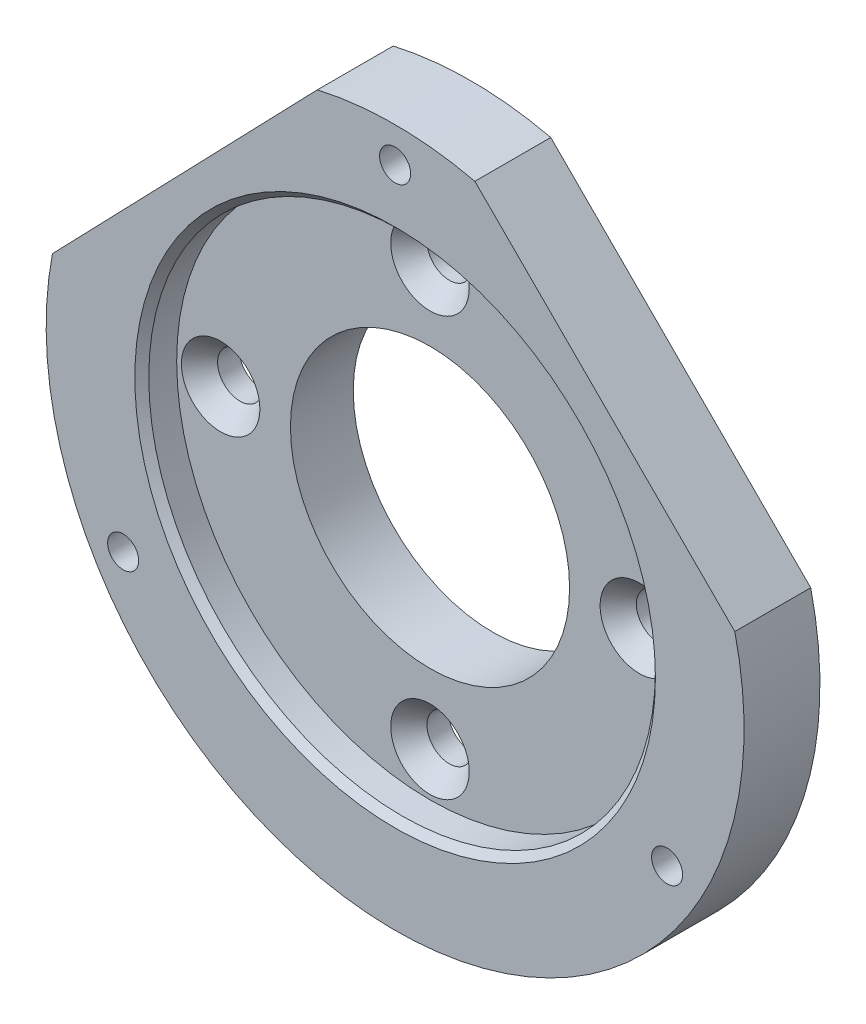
ISO-10303-21;
HEADER;
FILE_DESCRIPTION(('STEP AP214'),'2;1');
FILE_NAME('part.step','',(''),(''),'','','');
FILE_SCHEMA(('AUTOMOTIVE_DESIGN { 1 0 10303 214 1 1 1 1 }'));
ENDSEC;
DATA;
#1=APPLICATION_CONTEXT('core data for automotive mechanical design processes');
#2=APPLICATION_PROTOCOL_DEFINITION('international standard','automotive_design',2000,#1);
#3=PRODUCT_CONTEXT('',#1,'mechanical');
#4=PRODUCT('Part','Part','',(#3));
#5=PRODUCT_RELATED_PRODUCT_CATEGORY('part','',(#4));
#6=PRODUCT_DEFINITION_FORMATION('','',#4);
#7=PRODUCT_DEFINITION_CONTEXT('part definition',#1,'design');
#8=PRODUCT_DEFINITION('design','',#6,#7);
#9=PRODUCT_DEFINITION_SHAPE('','',#8);
#10=(LENGTH_UNIT() NAMED_UNIT(*) SI_UNIT(.MILLI.,.METRE.));
#11=(NAMED_UNIT(*) PLANE_ANGLE_UNIT() SI_UNIT($,.RADIAN.));
#12=(NAMED_UNIT(*) SI_UNIT($,.STERADIAN.) SOLID_ANGLE_UNIT());
#13=UNCERTAINTY_MEASURE_WITH_UNIT(LENGTH_MEASURE(1.E-05),#10,'distance_accuracy_value','');
#14=(GEOMETRIC_REPRESENTATION_CONTEXT(3) GLOBAL_UNCERTAINTY_ASSIGNED_CONTEXT((#13)) GLOBAL_UNIT_ASSIGNED_CONTEXT((#10,
#11,#12)) REPRESENTATION_CONTEXT('',''));
#15=CARTESIAN_POINT('',(0.,0.,0.));
#16=DIRECTION('',(0.,0.,1.));
#17=DIRECTION('',(1.,0.,0.));
#18=AXIS2_PLACEMENT_3D('',#15,#16,#17);
#19=CARTESIAN_POINT('',(0.,0.,7.112));
#20=DIRECTION('',(0.,0.,-1.));
#21=DIRECTION('',(-1.,0.,0.));
#22=AXIS2_PLACEMENT_3D('',#19,#20,#21);
#23=CYLINDRICAL_SURFACE('',#22,25.4);
#24=CARTESIAN_POINT('',(0.,0.,7.112));
#25=DIRECTION('',(0.,0.,1.));
#26=DIRECTION('',(1.,0.,0.));
#27=AXIS2_PLACEMENT_3D('',#24,#25,#26);
#28=CIRCLE('',#27,25.4);
#29=CARTESIAN_POINT('',(-24.9441152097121,4.790732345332,7.112));
#30=VERTEX_POINT('',#29);
#31=CARTESIAN_POINT('',(24.7277223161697,5.8051484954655,7.112));
#32=VERTEX_POINT('',#31);
#33=EDGE_CURVE('E100',#30,#32,#28,.T.);
#34=ORIENTED_EDGE('',*,*,#33,.F.);
#35=DIRECTION('',(0.,0.,-1.));
#36=VECTOR('',#35,1.);
#37=CARTESIAN_POINT('',(-24.9441152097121,4.79073234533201,7.112));
#38=LINE('',#37,#36);
#39=CARTESIAN_POINT('',(-24.9441152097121,4.79073234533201,1.5875));
#40=VERTEX_POINT('',#39);
#41=EDGE_CURVE('E84',#30,#40,#38,.T.);
#42=ORIENTED_EDGE('',*,*,#41,.T.);
#43=CARTESIAN_POINT('',(0.,0.,1.5875));
#44=DIRECTION('',(0.,0.,-1.));
#45=DIRECTION('',(-1.,0.,0.));
#46=AXIS2_PLACEMENT_3D('',#43,#44,#45);
#47=CIRCLE('',#46,25.4);
#48=CARTESIAN_POINT('',(24.7277223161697,5.80514849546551,1.5875));
#49=VERTEX_POINT('',#48);
#50=EDGE_CURVE('E178',#49,#40,#47,.T.);
#51=ORIENTED_EDGE('',*,*,#50,.F.);
#52=DIRECTION('',(0.,0.,-1.));
#53=VECTOR('',#52,1.);
#54=CARTESIAN_POINT('',(24.7277223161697,5.8051484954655,7.112));
#55=LINE('',#54,#53);
#56=EDGE_CURVE('E66',#49,#32,#55,.F.);
#57=ORIENTED_EDGE('',*,*,#56,.T.);
#58=EDGE_LOOP('',(#34,#42,#51,#57));
#59=FACE_BOUND('',#58,.T.);
#60=ADVANCED_FACE('F43',(#59),#23,.T.);
#61=CARTESIAN_POINT('',(-5.6623451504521,24.7608127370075,1.5875));
#62=VERTEX_POINT('',#61);
#63=CARTESIAN_POINT('',(5.80514849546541,24.7277223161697,1.5875));
#64=VERTEX_POINT('',#63);
#65=EDGE_CURVE('E175',#62,#64,#47,.T.);
#66=ORIENTED_EDGE('',*,*,#65,.F.);
#67=DIRECTION('',(0.,0.,-1.));
#68=VECTOR('',#67,1.);
#69=CARTESIAN_POINT('',(-5.6623451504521,24.7608127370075,7.112));
#70=LINE('',#69,#68);
#71=CARTESIAN_POINT('',(-5.66234515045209,24.7608127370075,7.112));
#72=VERTEX_POINT('',#71);
#73=EDGE_CURVE('E58',#62,#72,#70,.F.);
#74=ORIENTED_EDGE('',*,*,#73,.T.);
#75=CARTESIAN_POINT('',(5.8051484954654,24.7277223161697,7.112));
#76=VERTEX_POINT('',#75);
#77=EDGE_CURVE('E102',#76,#72,#28,.T.);
#78=ORIENTED_EDGE('',*,*,#77,.F.);
#79=DIRECTION('',(0.,0.,-1.));
#80=VECTOR('',#79,1.);
#81=CARTESIAN_POINT('',(5.8051484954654,24.7277223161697,7.112));
#82=LINE('',#81,#80);
#83=EDGE_CURVE('E176',#76,#64,#82,.T.);
#84=ORIENTED_EDGE('',*,*,#83,.T.);
#85=EDGE_LOOP('',(#66,#74,#78,#84));
#86=FACE_BOUND('',#85,.T.);
#87=ADVANCED_FACE('F45',(#86),#23,.T.);
#88=CARTESIAN_POINT('',(0.,0.,0.));
#89=DIRECTION('',(0.,0.,1.));
#90=DIRECTION('',(1.,0.,0.));
#91=AXIS2_PLACEMENT_3D('',#88,#89,#90);
#92=PLANE('',#91);
#93=CARTESIAN_POINT('',(0.,0.,0.));
#94=DIRECTION('',(0.,0.,1.));
#95=DIRECTION('',(1.,0.,0.));
#96=AXIS2_PLACEMENT_3D('',#93,#94,#95);
#97=CIRCLE('',#96,12.4206);
#98=CARTESIAN_POINT('',(12.4206,0.,0.));
#99=VERTEX_POINT('',#98);
#100=EDGE_CURVE('E51',#99,#99,#97,.F.);
#101=ORIENTED_EDGE('',*,*,#100,.T.);
#102=EDGE_LOOP('',(#101));
#103=FACE_BOUND('',#102,.T.);
#104=CARTESIAN_POINT('',(0.,0.,0.));
#105=DIRECTION('',(0.,0.,-1.));
#106=DIRECTION('',(-1.,0.,0.));
#107=AXIS2_PLACEMENT_3D('',#104,#105,#106);
#108=CIRCLE('',#107,10.16);
#109=CARTESIAN_POINT('',(-10.16,0.,0.));
#110=VERTEX_POINT('',#109);
#111=EDGE_CURVE('E104',#110,#110,#108,.T.);
#112=ORIENTED_EDGE('',*,*,#111,.F.);
#113=EDGE_LOOP('',(#112));
#114=FACE_BOUND('',#113,.T.);
#115=ADVANCED_FACE('F149',(#103,#114),#92,.F.);
#116=CARTESIAN_POINT('',(19.7973407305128,-11.4299999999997,0.));
#117=DIRECTION('',(0.,0.,1.));
#118=DIRECTION('',(1.,0.,0.));
#119=AXIS2_PLACEMENT_3D('',#116,#117,#118);
#120=CYLINDRICAL_SURFACE('',#119,1.13030000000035);
#121=CARTESIAN_POINT('',(19.7973407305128,-11.4299999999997,7.112));
#122=DIRECTION('',(0.,0.,1.));
#123=DIRECTION('',(1.,0.,0.));
#124=AXIS2_PLACEMENT_3D('',#121,#122,#123);
#125=CIRCLE('',#124,1.13030000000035);
#126=CARTESIAN_POINT('',(20.9276407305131,-11.4299999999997,7.112));
#127=VERTEX_POINT('',#126);
#128=EDGE_CURVE('E191',#127,#127,#125,.T.);
#129=ORIENTED_EDGE('',*,*,#128,.T.);
#130=EDGE_LOOP('',(#129));
#131=FACE_BOUND('',#130,.T.);
#132=CARTESIAN_POINT('',(19.7973407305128,-11.4299999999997,1.5875));
#133=DIRECTION('',(0.,0.,-1.));
#134=DIRECTION('',(-1.,0.,0.));
#135=AXIS2_PLACEMENT_3D('',#132,#133,#134);
#136=CIRCLE('',#135,1.13030000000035);
#137=CARTESIAN_POINT('',(18.6670407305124,-11.4299999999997,1.5875));
#138=VERTEX_POINT('',#137);
#139=EDGE_CURVE('E179',#138,#138,#136,.F.);
#140=ORIENTED_EDGE('',*,*,#139,.F.);
#141=EDGE_LOOP('',(#140));
#142=FACE_BOUND('',#141,.T.);
#143=ADVANCED_FACE('F171',(#131,#142),#120,.F.);
#144=CARTESIAN_POINT('',(-19.7973407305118,-11.4300000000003,0.));
#145=DIRECTION('',(0.,0.,1.));
#146=DIRECTION('',(1.,0.,0.));
#147=AXIS2_PLACEMENT_3D('',#144,#145,#146);
#148=CYLINDRICAL_SURFACE('',#147,1.13030000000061);
#149=CARTESIAN_POINT('',(-19.7973407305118,-11.4300000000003,7.112));
#150=DIRECTION('',(0.,0.,1.));
#151=DIRECTION('',(1.,0.,0.));
#152=AXIS2_PLACEMENT_3D('',#149,#150,#151);
#153=CIRCLE('',#152,1.13030000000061);
#154=CARTESIAN_POINT('',(-18.6670407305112,-11.4300000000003,7.112));
#155=VERTEX_POINT('',#154);
#156=EDGE_CURVE('E188',#155,#155,#153,.T.);
#157=ORIENTED_EDGE('',*,*,#156,.T.);
#158=EDGE_LOOP('',(#157));
#159=FACE_BOUND('',#158,.T.);
#160=CARTESIAN_POINT('',(-19.7973407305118,-11.4300000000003,1.5875));
#161=DIRECTION('',(0.,0.,-1.));
#162=DIRECTION('',(-1.,0.,0.));
#163=AXIS2_PLACEMENT_3D('',#160,#161,#162);
#164=CIRCLE('',#163,1.13030000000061);
#165=CARTESIAN_POINT('',(-20.9276407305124,-11.4300000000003,1.5875));
#166=VERTEX_POINT('',#165);
#167=EDGE_CURVE('E118',#166,#166,#164,.F.);
#168=ORIENTED_EDGE('',*,*,#167,.F.);
#169=EDGE_LOOP('',(#168));
#170=FACE_BOUND('',#169,.T.);
#171=ADVANCED_FACE('F384',(#159,#170),#148,.F.);
#172=CARTESIAN_POINT('',(0.,22.86,0.));
#173=DIRECTION('',(0.,0.,1.));
#174=DIRECTION('',(1.,0.,0.));
#175=AXIS2_PLACEMENT_3D('',#172,#173,#174);
#176=CYLINDRICAL_SURFACE('',#175,1.13029999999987);
#177=CARTESIAN_POINT('',(0.,22.86,7.112));
#178=DIRECTION('',(0.,0.,1.));
#179=DIRECTION('',(1.,0.,0.));
#180=AXIS2_PLACEMENT_3D('',#177,#178,#179);
#181=CIRCLE('',#180,1.13029999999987);
#182=CARTESIAN_POINT('',(1.13029999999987,22.86,7.112));
#183=VERTEX_POINT('',#182);
#184=EDGE_CURVE('E181',#183,#183,#181,.T.);
#185=ORIENTED_EDGE('',*,*,#184,.T.);
#186=EDGE_LOOP('',(#185));
#187=FACE_BOUND('',#186,.T.);
#188=CARTESIAN_POINT('',(0.,22.86,1.5875));
#189=DIRECTION('',(0.,0.,-1.));
#190=DIRECTION('',(-1.,0.,0.));
#191=AXIS2_PLACEMENT_3D('',#188,#189,#190);
#192=CIRCLE('',#191,1.13029999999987);
#193=CARTESIAN_POINT('',(-1.13029999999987,22.86,1.5875));
#194=VERTEX_POINT('',#193);
#195=EDGE_CURVE('E115',#194,#194,#192,.F.);
#196=ORIENTED_EDGE('',*,*,#195,.F.);
#197=EDGE_LOOP('',(#196));
#198=FACE_BOUND('',#197,.T.);
#199=ADVANCED_FACE('F216',(#187,#198),#176,.F.);
#200=CARTESIAN_POINT('',(0.,0.,7.112));
#201=DIRECTION('',(0.,0.,-1.));
#202=DIRECTION('',(-1.,0.,0.));
#203=AXIS2_PLACEMENT_3D('',#200,#201,#202);
#204=CYLINDRICAL_SURFACE('',#203,10.16);
#205=ORIENTED_EDGE('',*,*,#111,.T.);
#206=EDGE_LOOP('',(#205));
#207=FACE_BOUND('',#206,.T.);
#208=CARTESIAN_POINT('',(0.,0.,4.572));
#209=DIRECTION('',(0.,0.,1.));
#210=DIRECTION('',(1.,0.,0.));
#211=AXIS2_PLACEMENT_3D('',#208,#209,#210);
#212=CIRCLE('',#211,10.16);
#213=CARTESIAN_POINT('',(10.16,0.,4.572));
#214=VERTEX_POINT('',#213);
#215=EDGE_CURVE('E108',#214,#214,#212,.F.);
#216=ORIENTED_EDGE('',*,*,#215,.F.);
#217=EDGE_LOOP('',(#216));
#218=FACE_BOUND('',#217,.T.);
#219=ADVANCED_FACE('F214',(#207,#218),#204,.F.);
#220=CARTESIAN_POINT('',(0.,0.,7.112));
#221=DIRECTION('',(0.,0.,1.));
#222=DIRECTION('',(1.,0.,0.));
#223=AXIS2_PLACEMENT_3D('',#220,#221,#222);
#224=PLANE('',#223);
#225=CARTESIAN_POINT('',(0.,0.,7.112));
#226=DIRECTION('',(0.,0.,1.));
#227=DIRECTION('',(1.,0.,0.));
#228=AXIS2_PLACEMENT_3D('',#225,#226,#227);
#229=CIRCLE('',#228,18.9484);
#230=CARTESIAN_POINT('',(18.9484,0.,7.112));
#231=VERTEX_POINT('',#230);
#232=EDGE_CURVE('E144',#231,#231,#229,.F.);
#233=ORIENTED_EDGE('',*,*,#232,.T.);
#234=EDGE_LOOP('',(#233));
#235=FACE_BOUND('',#234,.T.);
#236=DIRECTION('',(0.694600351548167,0.719395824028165,0.));
#237=VECTOR('',#236,1.);
#238=CARTESIAN_POINT('',(-0.972137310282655,29.6184491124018,7.112));
#239=LINE('',#238,#237);
#240=EDGE_CURVE('E87',#30,#72,#239,.T.);
#241=ORIENTED_EDGE('',*,*,#240,.F.);
#242=ORIENTED_EDGE('',*,*,#33,.T.);
#243=DIRECTION('',(0.707106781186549,-0.707106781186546,0.));
#244=VECTOR('',#243,1.);
#245=CARTESIAN_POINT('',(0.898025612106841,29.6348451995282,7.112));
#246=LINE('',#245,#244);
#247=EDGE_CURVE('E93',#76,#32,#246,.T.);
#248=ORIENTED_EDGE('',*,*,#247,.F.);
#249=ORIENTED_EDGE('',*,*,#77,.T.);
#250=EDGE_LOOP('',(#241,#242,#248,#249));
#251=FACE_BOUND('',#250,.T.);
#252=ORIENTED_EDGE('',*,*,#184,.F.);
#253=EDGE_LOOP('',(#252));
#254=FACE_BOUND('',#253,.T.);
#255=ORIENTED_EDGE('',*,*,#156,.F.);
#256=EDGE_LOOP('',(#255));
#257=FACE_BOUND('',#256,.T.);
#258=ORIENTED_EDGE('',*,*,#128,.F.);
#259=EDGE_LOOP('',(#258));
#260=FACE_BOUND('',#259,.T.);
#261=ADVANCED_FACE('F97',(#235,#251,#254,#257,#260),#224,.T.);
#262=CARTESIAN_POINT('',(0.,0.,4.572));
#263=DIRECTION('',(0.,0.,1.));
#264=DIRECTION('',(1.,0.,0.));
#265=AXIS2_PLACEMENT_3D('',#262,#263,#264);
#266=PLANE('',#265);
#267=CARTESIAN_POINT('',(15.24,0.,4.572));
#268=DIRECTION('',(0.,0.,1.));
#269=DIRECTION('',(1.,0.,0.));
#270=AXIS2_PLACEMENT_3D('',#267,#268,#269);
#271=CIRCLE('',#270,2.8575);
#272=CARTESIAN_POINT('',(18.0975,0.,4.572));
#273=VERTEX_POINT('',#272);
#274=EDGE_CURVE('E138',#273,#273,#271,.T.);
#275=ORIENTED_EDGE('',*,*,#274,.F.);
#276=EDGE_LOOP('',(#275));
#277=FACE_BOUND('',#276,.T.);
#278=CARTESIAN_POINT('',(0.,-15.24,4.572));
#279=DIRECTION('',(0.,0.,1.));
#280=DIRECTION('',(1.,0.,0.));
#281=AXIS2_PLACEMENT_3D('',#278,#279,#280);
#282=CIRCLE('',#281,2.8575);
#283=CARTESIAN_POINT('',(2.85749999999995,-15.24,4.572));
#284=VERTEX_POINT('',#283);
#285=EDGE_CURVE('E133',#284,#284,#282,.T.);
#286=ORIENTED_EDGE('',*,*,#285,.F.);
#287=EDGE_LOOP('',(#286));
#288=FACE_BOUND('',#287,.T.);
#289=CARTESIAN_POINT('',(-15.24,1.06251812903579E-13,4.572));
#290=DIRECTION('',(0.,0.,1.));
#291=DIRECTION('',(1.,0.,0.));
#292=AXIS2_PLACEMENT_3D('',#289,#290,#291);
#293=CIRCLE('',#292,2.8575);
#294=CARTESIAN_POINT('',(-12.3825,1.06251812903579E-13,4.572));
#295=VERTEX_POINT('',#294);
#296=EDGE_CURVE('E128',#295,#295,#293,.T.);
#297=ORIENTED_EDGE('',*,*,#296,.F.);
#298=EDGE_LOOP('',(#297));
#299=FACE_BOUND('',#298,.T.);
#300=CARTESIAN_POINT('',(1.59594559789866E-13,15.24,4.572));
#301=DIRECTION('',(0.,0.,1.));
#302=DIRECTION('',(1.,0.,0.));
#303=AXIS2_PLACEMENT_3D('',#300,#301,#302);
#304=CIRCLE('',#303,2.8575);
#305=CARTESIAN_POINT('',(2.85750000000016,15.24,4.572));
#306=VERTEX_POINT('',#305);
#307=EDGE_CURVE('E123',#306,#306,#304,.T.);
#308=ORIENTED_EDGE('',*,*,#307,.F.);
#309=EDGE_LOOP('',(#308));
#310=FACE_BOUND('',#309,.T.);
#311=CARTESIAN_POINT('',(0.,0.,4.572));
#312=DIRECTION('',(0.,0.,1.));
#313=DIRECTION('',(1.,0.,0.));
#314=AXIS2_PLACEMENT_3D('',#311,#312,#313);
#315=CIRCLE('',#314,18.4404);
#316=CARTESIAN_POINT('',(18.4404,0.,4.572));
#317=VERTEX_POINT('',#316);
#318=EDGE_CURVE('E114',#317,#317,#315,.T.);
#319=ORIENTED_EDGE('',*,*,#318,.T.);
#320=EDGE_LOOP('',(#319));
#321=FACE_BOUND('',#320,.T.);
#322=ORIENTED_EDGE('',*,*,#215,.T.);
#323=EDGE_LOOP('',(#322));
#324=FACE_BOUND('',#323,.T.);
#325=ADVANCED_FACE('F196',(#277,#288,#299,#310,#321,#324),#266,.T.);
#326=CARTESIAN_POINT('',(0.,0.,4.572));
#327=DIRECTION('',(0.,0.,1.));
#328=DIRECTION('',(1.,0.,0.));
#329=AXIS2_PLACEMENT_3D('',#326,#327,#328);
#330=CYLINDRICAL_SURFACE('',#329,18.4404);
#331=CARTESIAN_POINT('',(0.,0.,6.60400000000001));
#332=DIRECTION('',(0.,0.,1.));
#333=DIRECTION('',(1.,0.,0.));
#334=AXIS2_PLACEMENT_3D('',#331,#332,#333);
#335=CIRCLE('',#334,18.4404);
#336=CARTESIAN_POINT('',(18.4404,0.,6.60400000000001));
#337=VERTEX_POINT('',#336);
#338=EDGE_CURVE('E141',#337,#337,#335,.T.);
#339=ORIENTED_EDGE('',*,*,#338,.T.);
#340=EDGE_LOOP('',(#339));
#341=FACE_BOUND('',#340,.T.);
#342=ORIENTED_EDGE('',*,*,#318,.F.);
#343=EDGE_LOOP('',(#342));
#344=FACE_BOUND('',#343,.T.);
#345=ADVANCED_FACE('F199',(#341,#344),#330,.F.);
#346=CARTESIAN_POINT('',(0.,0.,1.5875));
#347=DIRECTION('',(0.,0.,-1.));
#348=DIRECTION('',(-1.,0.,0.));
#349=AXIS2_PLACEMENT_3D('',#346,#347,#348);
#350=PLANE('',#349);
#351=DIRECTION('',(-0.694600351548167,-0.719395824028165,0.));
#352=VECTOR('',#351,1.);
#353=CARTESIAN_POINT('',(-15.3032301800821,14.7757725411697,1.5875));
#354=LINE('',#353,#352);
#355=EDGE_CURVE('E88',#62,#40,#354,.T.);
#356=ORIENTED_EDGE('',*,*,#355,.F.);
#357=ORIENTED_EDGE('',*,*,#65,.T.);
#358=DIRECTION('',(-0.707106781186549,0.707106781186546,0.));
#359=VECTOR('',#358,1.);
#360=CARTESIAN_POINT('',(15.2664354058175,15.2664354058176,1.5875));
#361=LINE('',#360,#359);
#362=EDGE_CURVE('E106',#49,#64,#361,.T.);
#363=ORIENTED_EDGE('',*,*,#362,.F.);
#364=ORIENTED_EDGE('',*,*,#50,.T.);
#365=EDGE_LOOP('',(#356,#357,#363,#364));
#366=FACE_BOUND('',#365,.T.);
#367=CARTESIAN_POINT('',(15.24,0.,1.5875));
#368=DIRECTION('',(0.,0.,-1.));
#369=DIRECTION('',(-1.,0.,0.));
#370=AXIS2_PLACEMENT_3D('',#367,#368,#369);
#371=CIRCLE('',#370,1.63195);
#372=CARTESIAN_POINT('',(13.60805,0.,1.5875));
#373=VERTEX_POINT('',#372);
#374=EDGE_CURVE('E134',#373,#373,#371,.T.);
#375=ORIENTED_EDGE('',*,*,#374,.F.);
#376=EDGE_LOOP('',(#375));
#377=FACE_BOUND('',#376,.T.);
#378=CARTESIAN_POINT('',(0.,-15.24,1.5875));
#379=DIRECTION('',(0.,0.,-1.));
#380=DIRECTION('',(-1.,0.,0.));
#381=AXIS2_PLACEMENT_3D('',#378,#379,#380);
#382=CIRCLE('',#381,1.63195);
#383=CARTESIAN_POINT('',(-1.63195000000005,-15.24,1.5875));
#384=VERTEX_POINT('',#383);
#385=EDGE_CURVE('E129',#384,#384,#382,.T.);
#386=ORIENTED_EDGE('',*,*,#385,.F.);
#387=EDGE_LOOP('',(#386));
#388=FACE_BOUND('',#387,.T.);
#389=CARTESIAN_POINT('',(-15.24,1.06251812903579E-13,1.5875));
#390=DIRECTION('',(0.,0.,-1.));
#391=DIRECTION('',(-1.,0.,0.));
#392=AXIS2_PLACEMENT_3D('',#389,#390,#391);
#393=CIRCLE('',#392,1.63195);
#394=CARTESIAN_POINT('',(-16.87195,1.06251812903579E-13,1.5875));
#395=VERTEX_POINT('',#394);
#396=EDGE_CURVE('E124',#395,#395,#393,.T.);
#397=ORIENTED_EDGE('',*,*,#396,.F.);
#398=EDGE_LOOP('',(#397));
#399=FACE_BOUND('',#398,.T.);
#400=CARTESIAN_POINT('',(1.59594559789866E-13,15.24,1.5875));
#401=DIRECTION('',(0.,0.,-1.));
#402=DIRECTION('',(-1.,0.,0.));
#403=AXIS2_PLACEMENT_3D('',#400,#401,#402);
#404=CIRCLE('',#403,1.63195);
#405=CARTESIAN_POINT('',(-1.63194999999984,15.24,1.5875));
#406=VERTEX_POINT('',#405);
#407=EDGE_CURVE('E120',#406,#406,#404,.T.);
#408=ORIENTED_EDGE('',*,*,#407,.F.);
#409=EDGE_LOOP('',(#408));
#410=FACE_BOUND('',#409,.T.);
#411=ORIENTED_EDGE('',*,*,#139,.T.);
#412=EDGE_LOOP('',(#411));
#413=FACE_BOUND('',#412,.T.);
#414=ORIENTED_EDGE('',*,*,#195,.T.);
#415=EDGE_LOOP('',(#414));
#416=FACE_BOUND('',#415,.T.);
#417=CARTESIAN_POINT('',(0.,0.,1.5875));
#418=DIRECTION('',(0.,0.,-1.));
#419=DIRECTION('',(-1.,0.,0.));
#420=AXIS2_PLACEMENT_3D('',#417,#418,#419);
#421=CIRCLE('',#420,12.6746);
#422=CARTESIAN_POINT('',(-12.6746,0.,1.5875));
#423=VERTEX_POINT('',#422);
#424=EDGE_CURVE('E119',#423,#423,#421,.T.);
#425=ORIENTED_EDGE('',*,*,#424,.F.);
#426=EDGE_LOOP('',(#425));
#427=FACE_BOUND('',#426,.T.);
#428=ORIENTED_EDGE('',*,*,#167,.T.);
#429=EDGE_LOOP('',(#428));
#430=FACE_BOUND('',#429,.T.);
#431=ADVANCED_FACE('F201',(#366,#377,#388,#399,#410,#413,#416,#427,#430),#350,.T.);
#432=CARTESIAN_POINT('',(0.,0.,1.5875));
#433=DIRECTION('',(0.,0.,-1.));
#434=DIRECTION('',(-1.,0.,0.));
#435=AXIS2_PLACEMENT_3D('',#432,#433,#434);
#436=CYLINDRICAL_SURFACE('',#435,12.6746);
#437=CARTESIAN_POINT('',(0.,0.,0.25400000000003));
#438=DIRECTION('',(0.,0.,1.));
#439=DIRECTION('',(1.,0.,0.));
#440=AXIS2_PLACEMENT_3D('',#437,#438,#439);
#441=CIRCLE('',#440,12.6746);
#442=CARTESIAN_POINT('',(12.6746,0.,0.25400000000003));
#443=VERTEX_POINT('',#442);
#444=EDGE_CURVE('E13',#443,#443,#441,.T.);
#445=ORIENTED_EDGE('',*,*,#444,.T.);
#446=EDGE_LOOP('',(#445));
#447=FACE_BOUND('',#446,.T.);
#448=ORIENTED_EDGE('',*,*,#424,.T.);
#449=EDGE_LOOP('',(#448));
#450=FACE_BOUND('',#449,.T.);
#451=ADVANCED_FACE('F208',(#447,#450),#436,.T.);
#452=CARTESIAN_POINT('',(1.59594559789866E-13,15.24,4.572));
#453=DIRECTION('',(0.,0.,1.));
#454=DIRECTION('',(1.,0.,0.));
#455=AXIS2_PLACEMENT_3D('',#452,#453,#454);
#456=CONICAL_SURFACE('',#455,2.8575,0.715584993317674);
#457=CARTESIAN_POINT('',(1.59594559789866E-13,15.24,3.16216599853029));
#458=DIRECTION('',(0.,0.,1.));
#459=DIRECTION('',(1.,0.,0.));
#460=AXIS2_PLACEMENT_3D('',#457,#458,#459);
#461=CIRCLE('',#460,1.63195);
#462=CARTESIAN_POINT('',(1.63195000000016,15.24,3.16216599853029));
#463=VERTEX_POINT('',#462);
#464=EDGE_CURVE('E127',#463,#463,#461,.T.);
#465=ORIENTED_EDGE('',*,*,#464,.F.);
#466=EDGE_LOOP('',(#465));
#467=FACE_BOUND('',#466,.T.);
#468=ORIENTED_EDGE('',*,*,#307,.T.);
#469=EDGE_LOOP('',(#468));
#470=FACE_BOUND('',#469,.T.);
#471=ADVANCED_FACE('F244',(#467,#470),#456,.F.);
#472=CARTESIAN_POINT('',(1.59594559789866E-13,15.24,4.572));
#473=DIRECTION('',(0.,0.,1.));
#474=DIRECTION('',(1.,0.,0.));
#475=AXIS2_PLACEMENT_3D('',#472,#473,#474);
#476=CYLINDRICAL_SURFACE('',#475,1.63195);
#477=ORIENTED_EDGE('',*,*,#407,.T.);
#478=EDGE_LOOP('',(#477));
#479=FACE_BOUND('',#478,.T.);
#480=ORIENTED_EDGE('',*,*,#464,.T.);
#481=EDGE_LOOP('',(#480));
#482=FACE_BOUND('',#481,.T.);
#483=ADVANCED_FACE('F249',(#479,#482),#476,.F.);
#484=CARTESIAN_POINT('',(-15.24,1.06251812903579E-13,4.572));
#485=DIRECTION('',(0.,0.,1.));
#486=DIRECTION('',(1.,0.,0.));
#487=AXIS2_PLACEMENT_3D('',#484,#485,#486);
#488=CONICAL_SURFACE('',#487,2.8575,0.715584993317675);
#489=CARTESIAN_POINT('',(-15.24,1.06251812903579E-13,3.16216599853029));
#490=DIRECTION('',(0.,0.,1.));
#491=DIRECTION('',(1.,0.,0.));
#492=AXIS2_PLACEMENT_3D('',#489,#490,#491);
#493=CIRCLE('',#492,1.63195);
#494=CARTESIAN_POINT('',(-13.60805,1.06251812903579E-13,3.16216599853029));
#495=VERTEX_POINT('',#494);
#496=EDGE_CURVE('E132',#495,#495,#493,.T.);
#497=ORIENTED_EDGE('',*,*,#496,.F.);
#498=EDGE_LOOP('',(#497));
#499=FACE_BOUND('',#498,.T.);
#500=ORIENTED_EDGE('',*,*,#296,.T.);
#501=EDGE_LOOP('',(#500));
#502=FACE_BOUND('',#501,.T.);
#503=ADVANCED_FACE('F261',(#499,#502),#488,.F.);
#504=CARTESIAN_POINT('',(-15.24,1.06251812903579E-13,4.572));
#505=DIRECTION('',(0.,0.,1.));
#506=DIRECTION('',(1.,0.,0.));
#507=AXIS2_PLACEMENT_3D('',#504,#505,#506);
#508=CYLINDRICAL_SURFACE('',#507,1.63195);
#509=ORIENTED_EDGE('',*,*,#396,.T.);
#510=EDGE_LOOP('',(#509));
#511=FACE_BOUND('',#510,.T.);
#512=ORIENTED_EDGE('',*,*,#496,.T.);
#513=EDGE_LOOP('',(#512));
#514=FACE_BOUND('',#513,.T.);
#515=ADVANCED_FACE('F271',(#511,#514),#508,.F.);
#516=CARTESIAN_POINT('',(0.,-15.24,4.572));
#517=DIRECTION('',(0.,0.,1.));
#518=DIRECTION('',(1.,0.,0.));
#519=AXIS2_PLACEMENT_3D('',#516,#517,#518);
#520=CONICAL_SURFACE('',#519,2.8575,0.715584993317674);
#521=CARTESIAN_POINT('',(0.,-15.24,3.16216599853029));
#522=DIRECTION('',(0.,0.,1.));
#523=DIRECTION('',(1.,0.,0.));
#524=AXIS2_PLACEMENT_3D('',#521,#522,#523);
#525=CIRCLE('',#524,1.63195);
#526=CARTESIAN_POINT('',(1.63194999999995,-15.24,3.16216599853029));
#527=VERTEX_POINT('',#526);
#528=EDGE_CURVE('E137',#527,#527,#525,.T.);
#529=ORIENTED_EDGE('',*,*,#528,.F.);
#530=EDGE_LOOP('',(#529));
#531=FACE_BOUND('',#530,.T.);
#532=ORIENTED_EDGE('',*,*,#285,.T.);
#533=EDGE_LOOP('',(#532));
#534=FACE_BOUND('',#533,.T.);
#535=ADVANCED_FACE('F281',(#531,#534),#520,.F.);
#536=CARTESIAN_POINT('',(0.,-15.24,4.572));
#537=DIRECTION('',(0.,0.,1.));
#538=DIRECTION('',(1.,0.,0.));
#539=AXIS2_PLACEMENT_3D('',#536,#537,#538);
#540=CYLINDRICAL_SURFACE('',#539,1.63195);
#541=ORIENTED_EDGE('',*,*,#385,.T.);
#542=EDGE_LOOP('',(#541));
#543=FACE_BOUND('',#542,.T.);
#544=ORIENTED_EDGE('',*,*,#528,.T.);
#545=EDGE_LOOP('',(#544));
#546=FACE_BOUND('',#545,.T.);
#547=ADVANCED_FACE('F291',(#543,#546),#540,.F.);
#548=CARTESIAN_POINT('',(15.24,0.,4.572));
#549=DIRECTION('',(0.,0.,1.));
#550=DIRECTION('',(1.,0.,0.));
#551=AXIS2_PLACEMENT_3D('',#548,#549,#550);
#552=CONICAL_SURFACE('',#551,2.8575,0.715584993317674);
#553=CARTESIAN_POINT('',(15.24,0.,3.16216599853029));
#554=DIRECTION('',(0.,0.,1.));
#555=DIRECTION('',(1.,0.,0.));
#556=AXIS2_PLACEMENT_3D('',#553,#554,#555);
#557=CIRCLE('',#556,1.63195);
#558=CARTESIAN_POINT('',(16.87195,0.,3.16216599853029));
#559=VERTEX_POINT('',#558);
#560=EDGE_CURVE('E420',#559,#559,#557,.T.);
#561=ORIENTED_EDGE('',*,*,#560,.F.);
#562=EDGE_LOOP('',(#561));
#563=FACE_BOUND('',#562,.T.);
#564=ORIENTED_EDGE('',*,*,#274,.T.);
#565=EDGE_LOOP('',(#564));
#566=FACE_BOUND('',#565,.T.);
#567=ADVANCED_FACE('F301',(#563,#566),#552,.F.);
#568=CARTESIAN_POINT('',(15.24,0.,4.572));
#569=DIRECTION('',(0.,0.,1.));
#570=DIRECTION('',(1.,0.,0.));
#571=AXIS2_PLACEMENT_3D('',#568,#569,#570);
#572=CYLINDRICAL_SURFACE('',#571,1.63195);
#573=ORIENTED_EDGE('',*,*,#374,.T.);
#574=EDGE_LOOP('',(#573));
#575=FACE_BOUND('',#574,.T.);
#576=ORIENTED_EDGE('',*,*,#560,.T.);
#577=EDGE_LOOP('',(#576));
#578=FACE_BOUND('',#577,.T.);
#579=ADVANCED_FACE('F311',(#575,#578),#572,.F.);
#580=CARTESIAN_POINT('',(0.898025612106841,29.6348451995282,0.));
#581=DIRECTION('',(-0.707106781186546,-0.707106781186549,0.));
#582=DIRECTION('',(0.707106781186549,-0.707106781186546,0.));
#583=AXIS2_PLACEMENT_3D('',#580,#581,#582);
#584=PLANE('',#583);
#585=ORIENTED_EDGE('',*,*,#247,.T.);
#586=ORIENTED_EDGE('',*,*,#56,.F.);
#587=ORIENTED_EDGE('',*,*,#362,.T.);
#588=ORIENTED_EDGE('',*,*,#83,.F.);
#589=EDGE_LOOP('',(#585,#586,#587,#588));
#590=FACE_BOUND('',#589,.T.);
#591=ADVANCED_FACE('F320',(#590),#584,.F.);
#592=CARTESIAN_POINT('',(-0.972137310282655,29.6184491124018,0.));
#593=DIRECTION('',(0.719395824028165,-0.694600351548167,0.));
#594=DIRECTION('',(0.694600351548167,0.719395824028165,0.));
#595=AXIS2_PLACEMENT_3D('',#592,#593,#594);
#596=PLANE('',#595);
#597=ORIENTED_EDGE('',*,*,#240,.T.);
#598=ORIENTED_EDGE('',*,*,#73,.F.);
#599=ORIENTED_EDGE('',*,*,#355,.T.);
#600=ORIENTED_EDGE('',*,*,#41,.F.);
#601=EDGE_LOOP('',(#597,#598,#599,#600));
#602=FACE_BOUND('',#601,.T.);
#603=ADVANCED_FACE('F86',(#602),#596,.F.);
#604=CARTESIAN_POINT('',(0.,0.,6.60400000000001));
#605=DIRECTION('',(0.,0.,1.));
#606=DIRECTION('',(1.,0.,0.));
#607=AXIS2_PLACEMENT_3D('',#604,#605,#606);
#608=CONICAL_SURFACE('',#607,18.4404,0.785398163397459);
#609=ORIENTED_EDGE('',*,*,#232,.F.);
#610=EDGE_LOOP('',(#609));
#611=FACE_BOUND('',#610,.T.);
#612=ORIENTED_EDGE('',*,*,#338,.F.);
#613=EDGE_LOOP('',(#612));
#614=FACE_BOUND('',#613,.T.);
#615=ADVANCED_FACE('F154',(#611,#614),#608,.F.);
#616=CARTESIAN_POINT('',(0.,0.,0.));
#617=DIRECTION('',(0.,0.,1.));
#618=DIRECTION('',(1.,0.,0.));
#619=AXIS2_PLACEMENT_3D('',#616,#617,#618);
#620=CONICAL_SURFACE('',#619,12.4206,0.785398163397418);
#621=ORIENTED_EDGE('',*,*,#444,.F.);
#622=EDGE_LOOP('',(#621));
#623=FACE_BOUND('',#622,.T.);
#624=ORIENTED_EDGE('',*,*,#100,.F.);
#625=EDGE_LOOP('',(#624));
#626=FACE_BOUND('',#625,.T.);
#627=ADVANCED_FACE('F152',(#623,#626),#620,.T.);
#628=CLOSED_SHELL('',(#60,#87,#115,#143,#171,#199,#219,#261,#325,#345,#431,#451,#471,#483,#503,
#515,#535,#547,#567,#579,#591,#603,#615,#627));
#629=MANIFOLD_SOLID_BREP('B2',#628);
#630=ADVANCED_BREP_SHAPE_REPRESENTATION('',(#18,#629),#14);
#631=SHAPE_DEFINITION_REPRESENTATION(#9,#630);
ENDSEC;
END-ISO-10303-21;
